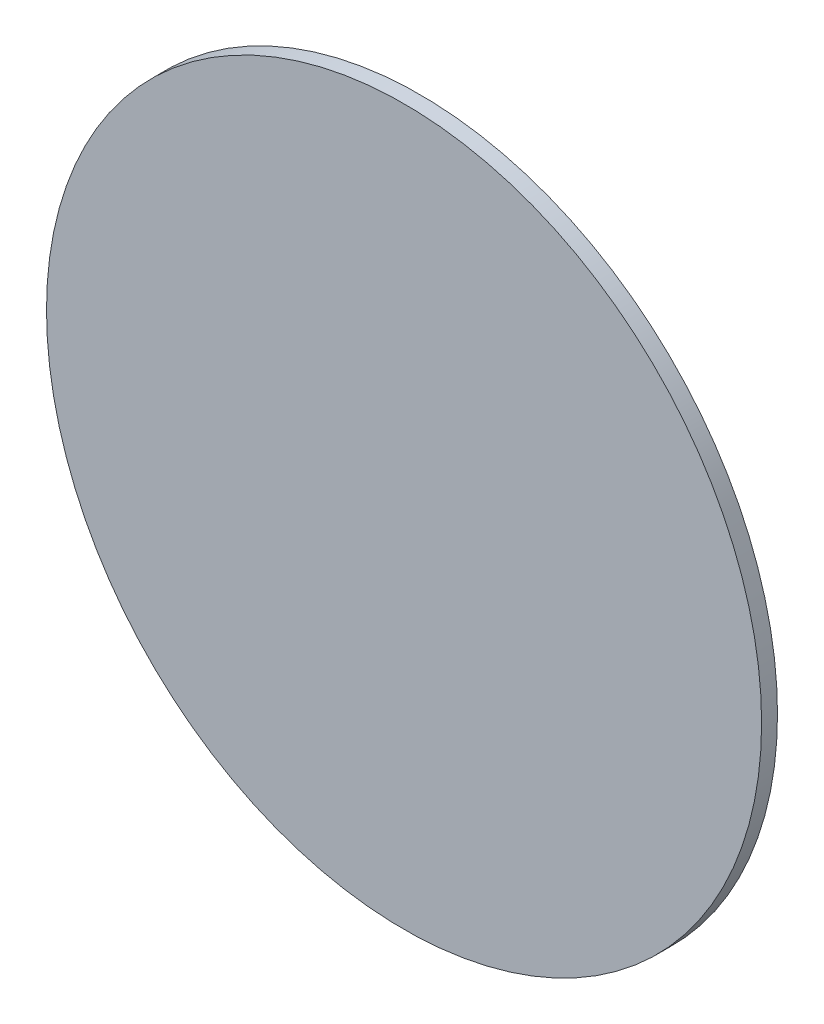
from build123d import *

# Parameters (mm, degrees)
ESQUISSE1_R        = 22.5
BOSS_EXTRU_1_DEPTH = 1


with BuildPart() as part:
    # Esquisse1 → Boss.-Extru.1 (new body)
    with BuildSketch(Plane.XY):
        Circle(ESQUISSE1_R)
    extrude(amount=BOSS_EXTRU_1_DEPTH)


solid = part.part
